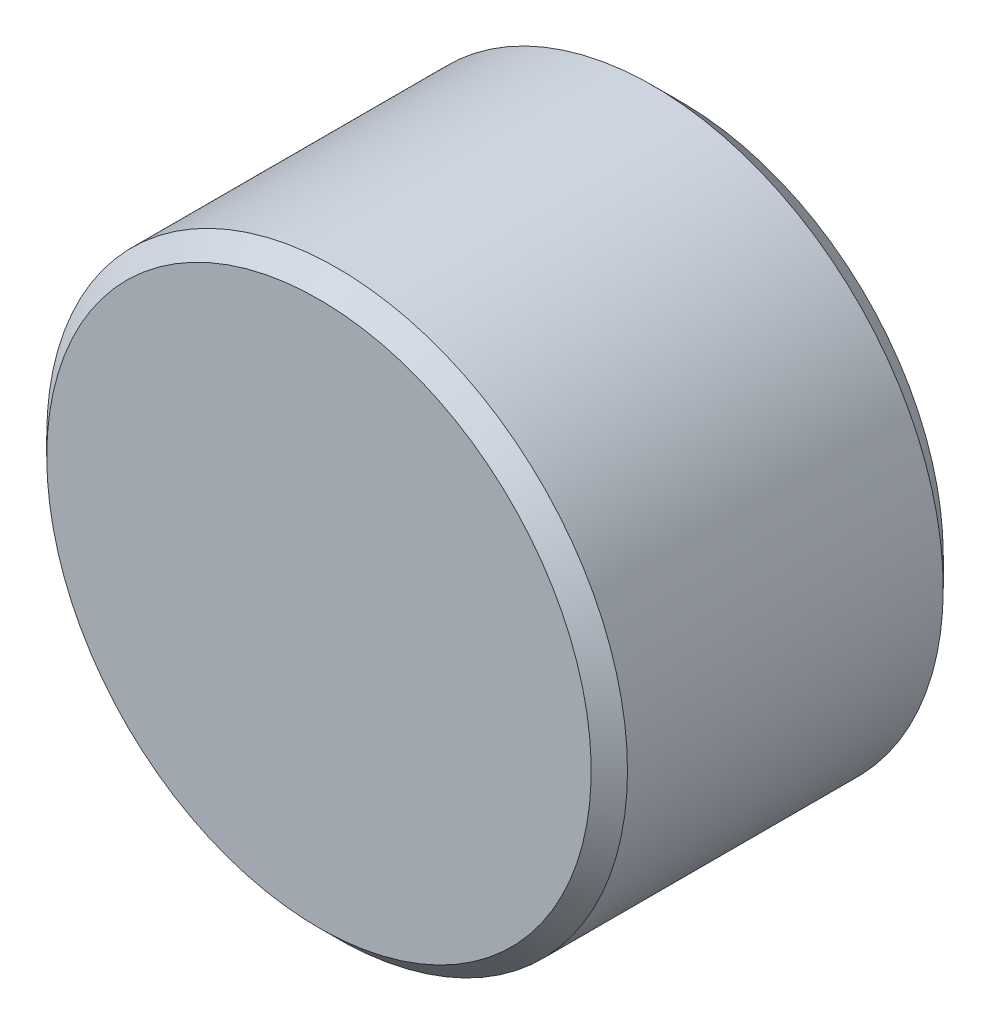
ISO-10303-21;
HEADER;
FILE_DESCRIPTION(('STEP AP214'),'2;1');
FILE_NAME('part.step','',(''),(''),'','','');
FILE_SCHEMA(('AUTOMOTIVE_DESIGN { 1 0 10303 214 1 1 1 1 }'));
ENDSEC;
DATA;
#1=APPLICATION_CONTEXT('core data for automotive mechanical design processes');
#2=APPLICATION_PROTOCOL_DEFINITION('international standard','automotive_design',2000,#1);
#3=PRODUCT_CONTEXT('',#1,'mechanical');
#4=PRODUCT('Part','Part','',(#3));
#5=PRODUCT_RELATED_PRODUCT_CATEGORY('part','',(#4));
#6=PRODUCT_DEFINITION_FORMATION('','',#4);
#7=PRODUCT_DEFINITION_CONTEXT('part definition',#1,'design');
#8=PRODUCT_DEFINITION('design','',#6,#7);
#9=PRODUCT_DEFINITION_SHAPE('','',#8);
#10=(LENGTH_UNIT() NAMED_UNIT(*) SI_UNIT(.MILLI.,.METRE.));
#11=(NAMED_UNIT(*) PLANE_ANGLE_UNIT() SI_UNIT($,.RADIAN.));
#12=(NAMED_UNIT(*) SI_UNIT($,.STERADIAN.) SOLID_ANGLE_UNIT());
#13=UNCERTAINTY_MEASURE_WITH_UNIT(LENGTH_MEASURE(1.E-05),#10,'distance_accuracy_value','');
#14=(GEOMETRIC_REPRESENTATION_CONTEXT(3) GLOBAL_UNCERTAINTY_ASSIGNED_CONTEXT((#13)) GLOBAL_UNIT_ASSIGNED_CONTEXT((#10,
#11,#12)) REPRESENTATION_CONTEXT('',''));
#15=CARTESIAN_POINT('',(0.,0.,0.));
#16=DIRECTION('',(0.,0.,1.));
#17=DIRECTION('',(1.,0.,0.));
#18=AXIS2_PLACEMENT_3D('',#15,#16,#17);
#19=CARTESIAN_POINT('',(0.,0.,30.));
#20=DIRECTION('',(0.,0.,1.));
#21=DIRECTION('',(1.,0.,0.));
#22=AXIS2_PLACEMENT_3D('',#19,#20,#21);
#23=CYLINDRICAL_SURFACE('',#22,8.);
#24=CARTESIAN_POINT('',(0.,0.,0.8));
#25=DIRECTION('',(0.,0.,1.));
#26=DIRECTION('',(1.,0.,0.));
#27=AXIS2_PLACEMENT_3D('',#24,#25,#26);
#28=CIRCLE('',#27,8.);
#29=CARTESIAN_POINT('',(8.,0.,0.8));
#30=VERTEX_POINT('',#29);
#31=EDGE_CURVE('E21',#30,#30,#28,.T.);
#32=ORIENTED_EDGE('',*,*,#31,.T.);
#33=EDGE_LOOP('',(#32));
#34=FACE_BOUND('',#33,.T.);
#35=CARTESIAN_POINT('',(0.,0.,9.5));
#36=DIRECTION('',(0.,0.,-1.));
#37=DIRECTION('',(-1.,0.,0.));
#38=AXIS2_PLACEMENT_3D('',#35,#36,#37);
#39=CIRCLE('',#38,8.);
#40=CARTESIAN_POINT('',(-8.,0.,9.5));
#41=VERTEX_POINT('',#40);
#42=EDGE_CURVE('E27',#41,#41,#39,.T.);
#43=ORIENTED_EDGE('',*,*,#42,.T.);
#44=EDGE_LOOP('',(#43));
#45=FACE_BOUND('',#44,.T.);
#46=ADVANCED_FACE('F13',(#34,#45),#23,.T.);
#47=CARTESIAN_POINT('',(8.,0.,10.));
#48=DIRECTION('',(0.,0.,-1.));
#49=DIRECTION('',(-1.,0.,0.));
#50=AXIS2_PLACEMENT_3D('',#47,#48,#49);
#51=PLANE('',#50);
#52=CARTESIAN_POINT('',(0.,0.,10.));
#53=DIRECTION('',(0.,0.,-1.));
#54=DIRECTION('',(-1.,0.,0.));
#55=AXIS2_PLACEMENT_3D('',#52,#53,#54);
#56=CIRCLE('',#55,7.5);
#57=CARTESIAN_POINT('',(-7.5,0.,10.));
#58=VERTEX_POINT('',#57);
#59=EDGE_CURVE('E32',#58,#58,#56,.F.);
#60=ORIENTED_EDGE('',*,*,#59,.T.);
#61=EDGE_LOOP('',(#60));
#62=FACE_BOUND('',#61,.T.);
#63=ADVANCED_FACE('F57',(#62),#51,.F.);
#64=CARTESIAN_POINT('',(0.,0.,5.));
#65=DIRECTION('',(0.,0.,1.));
#66=DIRECTION('',(1.,0.,0.));
#67=AXIS2_PLACEMENT_3D('',#64,#65,#66);
#68=PLANE('',#67);
#69=CARTESIAN_POINT('',(0.,0.,5.));
#70=DIRECTION('',(0.,0.,1.));
#71=DIRECTION('',(1.,0.,0.));
#72=AXIS2_PLACEMENT_3D('',#69,#70,#71);
#73=CIRCLE('',#72,3.);
#74=CARTESIAN_POINT('',(3.,0.,5.));
#75=VERTEX_POINT('',#74);
#76=EDGE_CURVE('E38',#75,#75,#73,.T.);
#77=ORIENTED_EDGE('',*,*,#76,.F.);
#78=EDGE_LOOP('',(#77));
#79=FACE_BOUND('',#78,.T.);
#80=ADVANCED_FACE('F52',(#79),#68,.F.);
#81=CARTESIAN_POINT('',(0.,0.,30.));
#82=DIRECTION('',(0.,0.,1.));
#83=DIRECTION('',(1.,0.,0.));
#84=AXIS2_PLACEMENT_3D('',#81,#82,#83);
#85=CYLINDRICAL_SURFACE('',#84,3.);
#86=CARTESIAN_POINT('',(0.,0.,0.));
#87=DIRECTION('',(0.,0.,1.));
#88=DIRECTION('',(1.,0.,0.));
#89=AXIS2_PLACEMENT_3D('',#86,#87,#88);
#90=CIRCLE('',#89,3.);
#91=CARTESIAN_POINT('',(3.,0.,0.));
#92=VERTEX_POINT('',#91);
#93=EDGE_CURVE('E42',#92,#92,#90,.T.);
#94=ORIENTED_EDGE('',*,*,#93,.F.);
#95=EDGE_LOOP('',(#94));
#96=FACE_BOUND('',#95,.T.);
#97=ORIENTED_EDGE('',*,*,#76,.T.);
#98=EDGE_LOOP('',(#97));
#99=FACE_BOUND('',#98,.T.);
#100=ADVANCED_FACE('F49',(#96,#99),#85,.F.);
#101=CARTESIAN_POINT('',(3.,0.,0.));
#102=DIRECTION('',(0.,0.,1.));
#103=DIRECTION('',(1.,0.,0.));
#104=AXIS2_PLACEMENT_3D('',#101,#102,#103);
#105=PLANE('',#104);
#106=CARTESIAN_POINT('',(0.,0.,0.));
#107=DIRECTION('',(0.,0.,1.));
#108=DIRECTION('',(1.,0.,0.));
#109=AXIS2_PLACEMENT_3D('',#106,#107,#108);
#110=CIRCLE('',#109,7.2);
#111=CARTESIAN_POINT('',(7.2,0.,0.));
#112=VERTEX_POINT('',#111);
#113=EDGE_CURVE('E8',#112,#112,#110,.F.);
#114=ORIENTED_EDGE('',*,*,#113,.T.);
#115=EDGE_LOOP('',(#114));
#116=FACE_BOUND('',#115,.T.);
#117=ORIENTED_EDGE('',*,*,#93,.T.);
#118=EDGE_LOOP('',(#117));
#119=FACE_BOUND('',#118,.T.);
#120=ADVANCED_FACE('F47',(#116,#119),#105,.F.);
#121=CARTESIAN_POINT('',(0.,0.,10.));
#122=DIRECTION('',(0.,0.,-1.));
#123=DIRECTION('',(-1.,0.,0.));
#124=AXIS2_PLACEMENT_3D('',#121,#122,#123);
#125=CONICAL_SURFACE('',#124,7.5,0.785398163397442);
#126=ORIENTED_EDGE('',*,*,#42,.F.);
#127=EDGE_LOOP('',(#126));
#128=FACE_BOUND('',#127,.T.);
#129=ORIENTED_EDGE('',*,*,#59,.F.);
#130=EDGE_LOOP('',(#129));
#131=FACE_BOUND('',#130,.T.);
#132=ADVANCED_FACE('F72',(#128,#131),#125,.T.);
#133=CARTESIAN_POINT('',(0.,0.,0.8));
#134=DIRECTION('',(0.,0.,1.));
#135=DIRECTION('',(1.,0.,0.));
#136=AXIS2_PLACEMENT_3D('',#133,#134,#135);
#137=CONICAL_SURFACE('',#136,8.,0.785398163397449);
#138=ORIENTED_EDGE('',*,*,#113,.F.);
#139=EDGE_LOOP('',(#138));
#140=FACE_BOUND('',#139,.T.);
#141=ORIENTED_EDGE('',*,*,#31,.F.);
#142=EDGE_LOOP('',(#141));
#143=FACE_BOUND('',#142,.T.);
#144=ADVANCED_FACE('F15',(#140,#143),#137,.T.);
#145=CLOSED_SHELL('',(#46,#63,#80,#100,#120,#132,#144));
#146=MANIFOLD_SOLID_BREP('B1',#145);
#147=ADVANCED_BREP_SHAPE_REPRESENTATION('',(#18,#146),#14);
#148=SHAPE_DEFINITION_REPRESENTATION(#9,#147);
ENDSEC;
END-ISO-10303-21;
